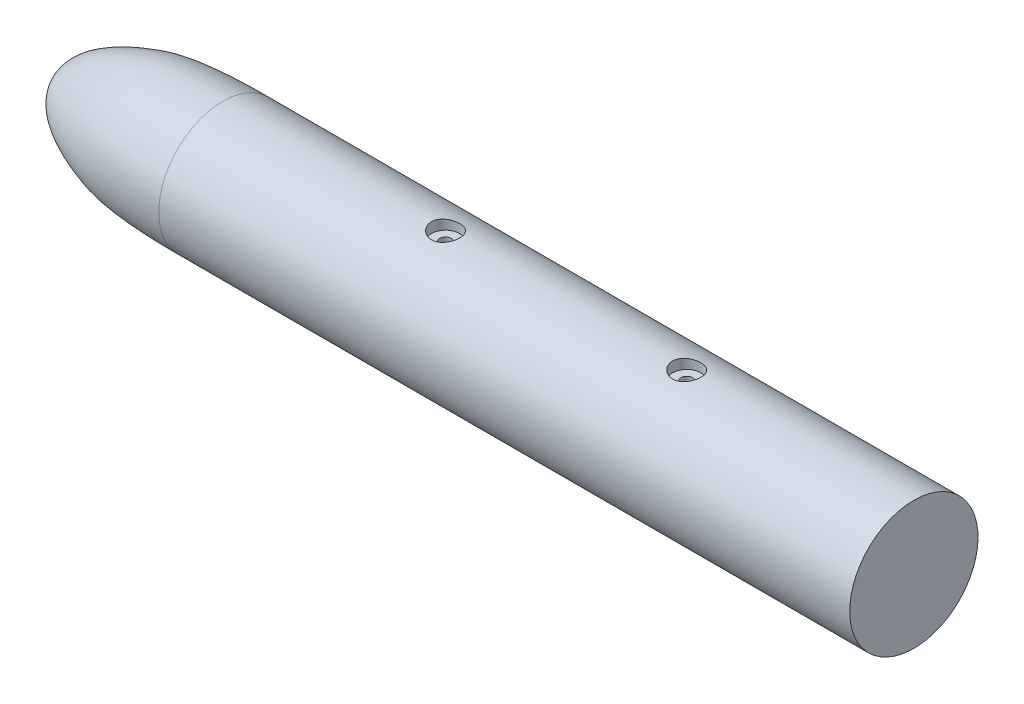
from build123d import *

# Parameters (mm, degrees)
STIRNSENKUNG_F_R_M8_SENKSCHRAUBE_KOPF_B_D           = 9
STIRNSENKUNG_F_R_M8_SENKSCHRAUBE_KOPF_B_CBORE_D     = 22
STIRNSENKUNG_F_R_M8_SENKSCHRAUBE_KOPF_B_CBORE_DEPTH = 8
STIRNSENKUNG_F_R_M8_SENKSCHRAUBE_KO_2_D             = 9
STIRNSENKUNG_F_R_M8_SENKSCHRAUBE_KO_2_CBORE_D       = 15
STIRNSENKUNG_F_R_M8_SENKSCHRAUBE_KO_2_CBORE_DEPTH   = 8


with BuildPart() as part:
    # Skizze4 → Rotation2 (revolve)
    with BuildSketch(Plane.XY):
        with BuildLine():
            Line((164.275013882, 124.144718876), (702.814210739, 124.144718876))
            Line((702.814210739, 124.144718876), (702.814210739, 74.144718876))
            Line((702.814210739, 74.144718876), (37.814210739, 74.144718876))
            add(Edge.make_bspline(
                [(164.275013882, 124.144718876), (136.095574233, 124.144718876), (107.837991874, 122.226315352), (74.834509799, 112.405956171), (37.814210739, 98.4388174), (37.814210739, 74.144718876)],
                knots=[0, 0, 0, 0, 0.389084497, 0.47274117, 1, 1, 1, 1], degree=3))
        make_face()
    revolve(axis=Axis((702.814210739, 74.144718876, 0), (-1, 0, 0)))

    # Stirnsenkung f_r M8 Senkschraube _Kopf B (through all)
    with Locations(Plane(origin=(0, 124.144718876, 0), x_dir=(1, 0, 0), z_dir=(0, 1, 0))):
        with Locations((525.814210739, 0), (337.814210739, 0)):
            CounterBoreHole(STIRNSENKUNG_F_R_M8_SENKSCHRAUBE_KOPF_B_D / 2, STIRNSENKUNG_F_R_M8_SENKSCHRAUBE_KOPF_B_CBORE_D / 2, STIRNSENKUNG_F_R_M8_SENKSCHRAUBE_KOPF_B_CBORE_DEPTH)

    # Stirnsenkung f_r M8 Senkschraube _Ko 2 (through all)
    with Locations(Plane(origin=(0, 24.144718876, 0), x_dir=(-1, 0, 0), z_dir=(0, -1, 0))):
        with Locations((-337.814210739, 0), (-525.814210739, 0)):
            CounterBoreHole(STIRNSENKUNG_F_R_M8_SENKSCHRAUBE_KO_2_D / 2, STIRNSENKUNG_F_R_M8_SENKSCHRAUBE_KO_2_CBORE_D / 2, STIRNSENKUNG_F_R_M8_SENKSCHRAUBE_KO_2_CBORE_DEPTH)


solid = part.part
